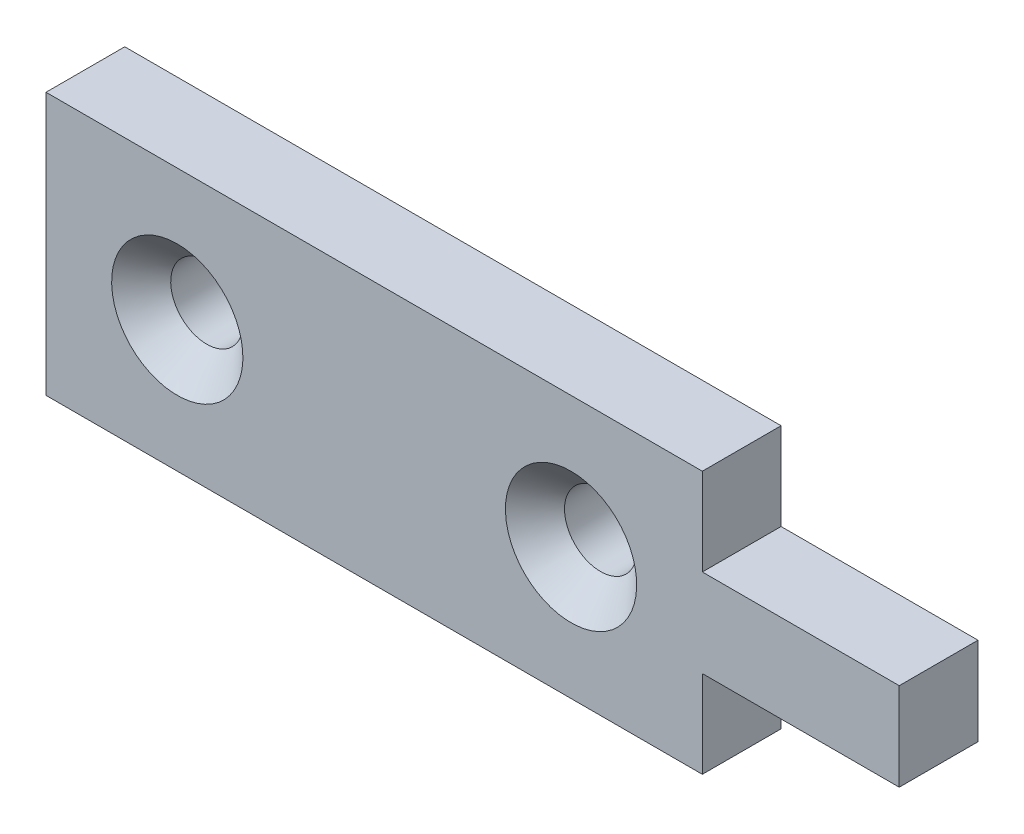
ISO-10303-21;
HEADER;
FILE_DESCRIPTION(('STEP AP214'),'2;1');
FILE_NAME('part.step','',(''),(''),'','','');
FILE_SCHEMA(('AUTOMOTIVE_DESIGN { 1 0 10303 214 1 1 1 1 }'));
ENDSEC;
DATA;
#1=APPLICATION_CONTEXT('core data for automotive mechanical design processes');
#2=APPLICATION_PROTOCOL_DEFINITION('international standard','automotive_design',2000,#1);
#3=PRODUCT_CONTEXT('',#1,'mechanical');
#4=PRODUCT('Part','Part','',(#3));
#5=PRODUCT_RELATED_PRODUCT_CATEGORY('part','',(#4));
#6=PRODUCT_DEFINITION_FORMATION('','',#4);
#7=PRODUCT_DEFINITION_CONTEXT('part definition',#1,'design');
#8=PRODUCT_DEFINITION('design','',#6,#7);
#9=PRODUCT_DEFINITION_SHAPE('','',#8);
#10=(LENGTH_UNIT() NAMED_UNIT(*) SI_UNIT(.MILLI.,.METRE.));
#11=(NAMED_UNIT(*) PLANE_ANGLE_UNIT() SI_UNIT($,.RADIAN.));
#12=(NAMED_UNIT(*) SI_UNIT($,.STERADIAN.) SOLID_ANGLE_UNIT());
#13=UNCERTAINTY_MEASURE_WITH_UNIT(LENGTH_MEASURE(1.E-05),#10,'distance_accuracy_value','');
#14=(GEOMETRIC_REPRESENTATION_CONTEXT(3) GLOBAL_UNCERTAINTY_ASSIGNED_CONTEXT((#13)) GLOBAL_UNIT_ASSIGNED_CONTEXT((#10,
#11,#12)) REPRESENTATION_CONTEXT('',''));
#15=CARTESIAN_POINT('',(0.,0.,0.));
#16=DIRECTION('',(0.,0.,1.));
#17=DIRECTION('',(1.,0.,0.));
#18=AXIS2_PLACEMENT_3D('',#15,#16,#17);
#19=CARTESIAN_POINT('',(55.,3.35,6.));
#20=DIRECTION('',(0.,0.,1.));
#21=DIRECTION('',(0.,1.,0.));
#22=AXIS2_PLACEMENT_3D('',#19,#20,#21);
#23=PLANE('',#22);
#24=CARTESIAN_POINT('',(0.,0.,6.));
#25=DIRECTION('',(0.,0.,1.));
#26=DIRECTION('',(0.,1.,0.));
#27=AXIS2_PLACEMENT_3D('',#24,#25,#26);
#28=CIRCLE('',#27,5.);
#29=CARTESIAN_POINT('',(0.,5.,6.));
#30=VERTEX_POINT('',#29);
#31=EDGE_CURVE('E22',#30,#30,#28,.F.);
#32=ORIENTED_EDGE('',*,*,#31,.T.);
#33=EDGE_LOOP('',(#32));
#34=FACE_BOUND('',#33,.T.);
#35=CARTESIAN_POINT('',(30.,0.,6.));
#36=DIRECTION('',(0.,0.,1.));
#37=DIRECTION('',(0.,1.,0.));
#38=AXIS2_PLACEMENT_3D('',#35,#36,#37);
#39=CIRCLE('',#38,5.);
#40=CARTESIAN_POINT('',(30.,5.,6.));
#41=VERTEX_POINT('',#40);
#42=EDGE_CURVE('E153',#41,#41,#39,.F.);
#43=ORIENTED_EDGE('',*,*,#42,.T.);
#44=EDGE_LOOP('',(#43));
#45=FACE_BOUND('',#44,.T.);
#46=DIRECTION('',(0.,1.,0.));
#47=VECTOR('',#46,1.);
#48=CARTESIAN_POINT('',(55.,-3.35,6.));
#49=LINE('',#48,#47);
#50=CARTESIAN_POINT('',(55.,-3.35,6.));
#51=VERTEX_POINT('',#50);
#52=CARTESIAN_POINT('',(55.,3.35,6.));
#53=VERTEX_POINT('',#52);
#54=EDGE_CURVE('E121',#51,#53,#49,.T.);
#55=ORIENTED_EDGE('',*,*,#54,.T.);
#56=DIRECTION('',(-1.,0.,0.));
#57=VECTOR('',#56,1.);
#58=CARTESIAN_POINT('',(55.,3.35,6.));
#59=LINE('',#58,#57);
#60=CARTESIAN_POINT('',(40.,3.35,6.));
#61=VERTEX_POINT('',#60);
#62=EDGE_CURVE('E95',#53,#61,#59,.T.);
#63=ORIENTED_EDGE('',*,*,#62,.T.);
#64=DIRECTION('',(0.,1.,0.));
#65=VECTOR('',#64,1.);
#66=CARTESIAN_POINT('',(40.,3.35,6.));
#67=LINE('',#66,#65);
#68=CARTESIAN_POINT('',(40.,10.,6.));
#69=VERTEX_POINT('',#68);
#70=EDGE_CURVE('E124',#61,#69,#67,.T.);
#71=ORIENTED_EDGE('',*,*,#70,.T.);
#72=DIRECTION('',(-1.,0.,0.));
#73=VECTOR('',#72,1.);
#74=CARTESIAN_POINT('',(40.,10.,6.));
#75=LINE('',#74,#73);
#76=CARTESIAN_POINT('',(-10.,10.,6.));
#77=VERTEX_POINT('',#76);
#78=EDGE_CURVE('E126',#69,#77,#75,.T.);
#79=ORIENTED_EDGE('',*,*,#78,.T.);
#80=DIRECTION('',(0.,-1.,0.));
#81=VECTOR('',#80,1.);
#82=CARTESIAN_POINT('',(-10.,-10.,6.));
#83=LINE('',#82,#81);
#84=CARTESIAN_POINT('',(-10.,-10.,6.));
#85=VERTEX_POINT('',#84);
#86=EDGE_CURVE('E128',#77,#85,#83,.T.);
#87=ORIENTED_EDGE('',*,*,#86,.T.);
#88=DIRECTION('',(1.,0.,0.));
#89=VECTOR('',#88,1.);
#90=CARTESIAN_POINT('',(40.,-10.,6.));
#91=LINE('',#90,#89);
#92=CARTESIAN_POINT('',(40.,-10.,6.));
#93=VERTEX_POINT('',#92);
#94=EDGE_CURVE('E130',#85,#93,#91,.T.);
#95=ORIENTED_EDGE('',*,*,#94,.T.);
#96=DIRECTION('',(0.,1.,0.));
#97=VECTOR('',#96,1.);
#98=CARTESIAN_POINT('',(40.,-3.35,6.));
#99=LINE('',#98,#97);
#100=CARTESIAN_POINT('',(40.,-3.35,6.));
#101=VERTEX_POINT('',#100);
#102=EDGE_CURVE('E34',#93,#101,#99,.T.);
#103=ORIENTED_EDGE('',*,*,#102,.T.);
#104=DIRECTION('',(1.,0.,0.));
#105=VECTOR('',#104,1.);
#106=CARTESIAN_POINT('',(55.,-3.35,6.));
#107=LINE('',#106,#105);
#108=EDGE_CURVE('E29',#101,#51,#107,.T.);
#109=ORIENTED_EDGE('',*,*,#108,.T.);
#110=EDGE_LOOP('',(#55,#63,#71,#79,#87,#95,#103,#109));
#111=FACE_BOUND('',#110,.T.);
#112=ADVANCED_FACE('F14',(#34,#45,#111),#23,.T.);
#113=CARTESIAN_POINT('',(55.,3.35,0.));
#114=DIRECTION('',(0.,0.,1.));
#115=DIRECTION('',(0.,1.,0.));
#116=AXIS2_PLACEMENT_3D('',#113,#114,#115);
#117=PLANE('',#116);
#118=CARTESIAN_POINT('',(30.,0.,0.));
#119=DIRECTION('',(0.,0.,1.));
#120=DIRECTION('',(0.,1.,0.));
#121=AXIS2_PLACEMENT_3D('',#118,#119,#120);
#122=CIRCLE('',#121,2.75);
#123=CARTESIAN_POINT('',(30.,2.75,0.));
#124=VERTEX_POINT('',#123);
#125=EDGE_CURVE('E103',#124,#124,#122,.T.);
#126=ORIENTED_EDGE('',*,*,#125,.T.);
#127=EDGE_LOOP('',(#126));
#128=FACE_BOUND('',#127,.T.);
#129=DIRECTION('',(0.,1.,0.));
#130=VECTOR('',#129,1.);
#131=CARTESIAN_POINT('',(55.,-3.35,0.));
#132=LINE('',#131,#130);
#133=CARTESIAN_POINT('',(55.,-3.35,0.));
#134=VERTEX_POINT('',#133);
#135=CARTESIAN_POINT('',(55.,3.35,0.));
#136=VERTEX_POINT('',#135);
#137=EDGE_CURVE('E85',#134,#136,#132,.T.);
#138=ORIENTED_EDGE('',*,*,#137,.F.);
#139=DIRECTION('',(1.,0.,0.));
#140=VECTOR('',#139,1.);
#141=CARTESIAN_POINT('',(55.,-3.35,0.));
#142=LINE('',#141,#140);
#143=CARTESIAN_POINT('',(40.,-3.35,0.));
#144=VERTEX_POINT('',#143);
#145=EDGE_CURVE('E119',#144,#134,#142,.T.);
#146=ORIENTED_EDGE('',*,*,#145,.F.);
#147=DIRECTION('',(0.,1.,0.));
#148=VECTOR('',#147,1.);
#149=CARTESIAN_POINT('',(40.,-3.35,0.));
#150=LINE('',#149,#148);
#151=CARTESIAN_POINT('',(40.,-10.,0.));
#152=VERTEX_POINT('',#151);
#153=EDGE_CURVE('E117',#152,#144,#150,.T.);
#154=ORIENTED_EDGE('',*,*,#153,.F.);
#155=DIRECTION('',(1.,0.,0.));
#156=VECTOR('',#155,1.);
#157=CARTESIAN_POINT('',(40.,-10.,0.));
#158=LINE('',#157,#156);
#159=CARTESIAN_POINT('',(-10.,-10.,0.));
#160=VERTEX_POINT('',#159);
#161=EDGE_CURVE('E115',#160,#152,#158,.T.);
#162=ORIENTED_EDGE('',*,*,#161,.F.);
#163=DIRECTION('',(0.,-1.,0.));
#164=VECTOR('',#163,1.);
#165=CARTESIAN_POINT('',(-10.,-10.,0.));
#166=LINE('',#165,#164);
#167=CARTESIAN_POINT('',(-10.,10.,0.));
#168=VERTEX_POINT('',#167);
#169=EDGE_CURVE('E113',#168,#160,#166,.T.);
#170=ORIENTED_EDGE('',*,*,#169,.F.);
#171=DIRECTION('',(-1.,0.,0.));
#172=VECTOR('',#171,1.);
#173=CARTESIAN_POINT('',(40.,10.,0.));
#174=LINE('',#173,#172);
#175=CARTESIAN_POINT('',(40.,10.,0.));
#176=VERTEX_POINT('',#175);
#177=EDGE_CURVE('E111',#176,#168,#174,.T.);
#178=ORIENTED_EDGE('',*,*,#177,.F.);
#179=DIRECTION('',(0.,1.,0.));
#180=VECTOR('',#179,1.);
#181=CARTESIAN_POINT('',(40.,3.35,0.));
#182=LINE('',#181,#180);
#183=CARTESIAN_POINT('',(40.,3.35,0.));
#184=VERTEX_POINT('',#183);
#185=EDGE_CURVE('E87',#184,#176,#182,.T.);
#186=ORIENTED_EDGE('',*,*,#185,.F.);
#187=DIRECTION('',(-1.,0.,0.));
#188=VECTOR('',#187,1.);
#189=CARTESIAN_POINT('',(55.,3.35,0.));
#190=LINE('',#189,#188);
#191=EDGE_CURVE('E79',#136,#184,#190,.T.);
#192=ORIENTED_EDGE('',*,*,#191,.F.);
#193=EDGE_LOOP('',(#138,#146,#154,#162,#170,#178,#186,#192));
#194=FACE_BOUND('',#193,.T.);
#195=CARTESIAN_POINT('',(0.,0.,0.));
#196=DIRECTION('',(0.,0.,1.));
#197=DIRECTION('',(0.,1.,0.));
#198=AXIS2_PLACEMENT_3D('',#195,#196,#197);
#199=CIRCLE('',#198,2.75);
#200=CARTESIAN_POINT('',(0.,2.75,0.));
#201=VERTEX_POINT('',#200);
#202=EDGE_CURVE('E106',#201,#201,#199,.T.);
#203=ORIENTED_EDGE('',*,*,#202,.T.);
#204=EDGE_LOOP('',(#203));
#205=FACE_BOUND('',#204,.T.);
#206=ADVANCED_FACE('F81',(#128,#194,#205),#117,.F.);
#207=CARTESIAN_POINT('',(55.,-3.35,6.));
#208=DIRECTION('',(-1.,0.,0.));
#209=DIRECTION('',(0.,-1.,0.));
#210=AXIS2_PLACEMENT_3D('',#207,#208,#209);
#211=PLANE('',#210);
#212=ORIENTED_EDGE('',*,*,#137,.T.);
#213=DIRECTION('',(0.,0.,-1.));
#214=VECTOR('',#213,1.);
#215=CARTESIAN_POINT('',(55.,3.35,6.));
#216=LINE('',#215,#214);
#217=EDGE_CURVE('E93',#53,#136,#216,.T.);
#218=ORIENTED_EDGE('',*,*,#217,.F.);
#219=ORIENTED_EDGE('',*,*,#54,.F.);
#220=DIRECTION('',(0.,0.,-1.));
#221=VECTOR('',#220,1.);
#222=CARTESIAN_POINT('',(55.,-3.35,6.));
#223=LINE('',#222,#221);
#224=EDGE_CURVE('E102',#51,#134,#223,.T.);
#225=ORIENTED_EDGE('',*,*,#224,.T.);
#226=EDGE_LOOP('',(#212,#218,#219,#225));
#227=FACE_BOUND('',#226,.T.);
#228=ADVANCED_FACE('F16',(#227),#211,.F.);
#229=CARTESIAN_POINT('',(55.,3.35,6.));
#230=DIRECTION('',(0.,-1.,0.));
#231=DIRECTION('',(1.,0.,0.));
#232=AXIS2_PLACEMENT_3D('',#229,#230,#231);
#233=PLANE('',#232);
#234=ORIENTED_EDGE('',*,*,#191,.T.);
#235=DIRECTION('',(0.,0.,-1.));
#236=VECTOR('',#235,1.);
#237=CARTESIAN_POINT('',(40.,3.35,6.));
#238=LINE('',#237,#236);
#239=EDGE_CURVE('E99',#61,#184,#238,.T.);
#240=ORIENTED_EDGE('',*,*,#239,.F.);
#241=ORIENTED_EDGE('',*,*,#62,.F.);
#242=ORIENTED_EDGE('',*,*,#217,.T.);
#243=EDGE_LOOP('',(#234,#240,#241,#242));
#244=FACE_BOUND('',#243,.T.);
#245=ADVANCED_FACE('F94',(#244),#233,.F.);
#246=CARTESIAN_POINT('',(40.,3.35,6.));
#247=DIRECTION('',(-1.,0.,0.));
#248=DIRECTION('',(0.,-1.,0.));
#249=AXIS2_PLACEMENT_3D('',#246,#247,#248);
#250=PLANE('',#249);
#251=ORIENTED_EDGE('',*,*,#185,.T.);
#252=DIRECTION('',(0.,0.,-1.));
#253=VECTOR('',#252,1.);
#254=CARTESIAN_POINT('',(40.,10.,6.));
#255=LINE('',#254,#253);
#256=EDGE_CURVE('E147',#69,#176,#255,.T.);
#257=ORIENTED_EDGE('',*,*,#256,.F.);
#258=ORIENTED_EDGE('',*,*,#70,.F.);
#259=ORIENTED_EDGE('',*,*,#239,.T.);
#260=EDGE_LOOP('',(#251,#257,#258,#259));
#261=FACE_BOUND('',#260,.T.);
#262=ADVANCED_FACE('F205',(#261),#250,.F.);
#263=CARTESIAN_POINT('',(40.,10.,6.));
#264=DIRECTION('',(0.,-1.,0.));
#265=DIRECTION('',(1.,0.,0.));
#266=AXIS2_PLACEMENT_3D('',#263,#264,#265);
#267=PLANE('',#266);
#268=ORIENTED_EDGE('',*,*,#177,.T.);
#269=DIRECTION('',(0.,0.,-1.));
#270=VECTOR('',#269,1.);
#271=CARTESIAN_POINT('',(-10.,10.,6.));
#272=LINE('',#271,#270);
#273=EDGE_CURVE('E144',#77,#168,#272,.T.);
#274=ORIENTED_EDGE('',*,*,#273,.F.);
#275=ORIENTED_EDGE('',*,*,#78,.F.);
#276=ORIENTED_EDGE('',*,*,#256,.T.);
#277=EDGE_LOOP('',(#268,#274,#275,#276));
#278=FACE_BOUND('',#277,.T.);
#279=ADVANCED_FACE('F201',(#278),#267,.F.);
#280=CARTESIAN_POINT('',(-10.,-10.,6.));
#281=DIRECTION('',(1.,0.,0.));
#282=DIRECTION('',(0.,1.,0.));
#283=AXIS2_PLACEMENT_3D('',#280,#281,#282);
#284=PLANE('',#283);
#285=ORIENTED_EDGE('',*,*,#169,.T.);
#286=DIRECTION('',(0.,0.,-1.));
#287=VECTOR('',#286,1.);
#288=CARTESIAN_POINT('',(-10.,-10.,6.));
#289=LINE('',#288,#287);
#290=EDGE_CURVE('E141',#85,#160,#289,.T.);
#291=ORIENTED_EDGE('',*,*,#290,.F.);
#292=ORIENTED_EDGE('',*,*,#86,.F.);
#293=ORIENTED_EDGE('',*,*,#273,.T.);
#294=EDGE_LOOP('',(#285,#291,#292,#293));
#295=FACE_BOUND('',#294,.T.);
#296=ADVANCED_FACE('F197',(#295),#284,.F.);
#297=CARTESIAN_POINT('',(40.,-10.,6.));
#298=DIRECTION('',(0.,1.,0.));
#299=DIRECTION('',(-1.,0.,0.));
#300=AXIS2_PLACEMENT_3D('',#297,#298,#299);
#301=PLANE('',#300);
#302=ORIENTED_EDGE('',*,*,#161,.T.);
#303=DIRECTION('',(0.,0.,-1.));
#304=VECTOR('',#303,1.);
#305=CARTESIAN_POINT('',(40.,-10.,6.));
#306=LINE('',#305,#304);
#307=EDGE_CURVE('E138',#93,#152,#306,.T.);
#308=ORIENTED_EDGE('',*,*,#307,.F.);
#309=ORIENTED_EDGE('',*,*,#94,.F.);
#310=ORIENTED_EDGE('',*,*,#290,.T.);
#311=EDGE_LOOP('',(#302,#308,#309,#310));
#312=FACE_BOUND('',#311,.T.);
#313=ADVANCED_FACE('F193',(#312),#301,.F.);
#314=CARTESIAN_POINT('',(40.,-3.35,6.));
#315=DIRECTION('',(-1.,0.,0.));
#316=DIRECTION('',(0.,-1.,0.));
#317=AXIS2_PLACEMENT_3D('',#314,#315,#316);
#318=PLANE('',#317);
#319=ORIENTED_EDGE('',*,*,#153,.T.);
#320=DIRECTION('',(0.,0.,-1.));
#321=VECTOR('',#320,1.);
#322=CARTESIAN_POINT('',(40.,-3.35,6.));
#323=LINE('',#322,#321);
#324=EDGE_CURVE('E135',#101,#144,#323,.T.);
#325=ORIENTED_EDGE('',*,*,#324,.F.);
#326=ORIENTED_EDGE('',*,*,#102,.F.);
#327=ORIENTED_EDGE('',*,*,#307,.T.);
#328=EDGE_LOOP('',(#319,#325,#326,#327));
#329=FACE_BOUND('',#328,.T.);
#330=ADVANCED_FACE('F189',(#329),#318,.F.);
#331=CARTESIAN_POINT('',(55.,-3.35,6.));
#332=DIRECTION('',(0.,1.,0.));
#333=DIRECTION('',(-1.,0.,0.));
#334=AXIS2_PLACEMENT_3D('',#331,#332,#333);
#335=PLANE('',#334);
#336=ORIENTED_EDGE('',*,*,#145,.T.);
#337=ORIENTED_EDGE('',*,*,#224,.F.);
#338=ORIENTED_EDGE('',*,*,#108,.F.);
#339=ORIENTED_EDGE('',*,*,#324,.T.);
#340=EDGE_LOOP('',(#336,#337,#338,#339));
#341=FACE_BOUND('',#340,.T.);
#342=ADVANCED_FACE('F186',(#341),#335,.F.);
#343=CARTESIAN_POINT('',(30.,0.,6.));
#344=DIRECTION('',(0.,0.,-1.));
#345=DIRECTION('',(0.,-1.,0.));
#346=AXIS2_PLACEMENT_3D('',#343,#344,#345);
#347=CYLINDRICAL_SURFACE('',#346,2.75);
#348=CARTESIAN_POINT('',(30.,0.,3.75));
#349=DIRECTION('',(0.,0.,1.));
#350=DIRECTION('',(0.,1.,0.));
#351=AXIS2_PLACEMENT_3D('',#348,#349,#350);
#352=CIRCLE('',#351,2.75);
#353=CARTESIAN_POINT('',(30.,2.75,3.75));
#354=VERTEX_POINT('',#353);
#355=EDGE_CURVE('E9',#354,#354,#352,.T.);
#356=ORIENTED_EDGE('',*,*,#355,.T.);
#357=EDGE_LOOP('',(#356));
#358=FACE_BOUND('',#357,.T.);
#359=ORIENTED_EDGE('',*,*,#125,.F.);
#360=EDGE_LOOP('',(#359));
#361=FACE_BOUND('',#360,.T.);
#362=ADVANCED_FACE('F170',(#358,#361),#347,.F.);
#363=CARTESIAN_POINT('',(0.,0.,6.));
#364=DIRECTION('',(0.,0.,-1.));
#365=DIRECTION('',(0.,-1.,0.));
#366=AXIS2_PLACEMENT_3D('',#363,#364,#365);
#367=CYLINDRICAL_SURFACE('',#366,2.75);
#368=CARTESIAN_POINT('',(0.,0.,3.75));
#369=DIRECTION('',(0.,0.,1.));
#370=DIRECTION('',(0.,1.,0.));
#371=AXIS2_PLACEMENT_3D('',#368,#369,#370);
#372=CIRCLE('',#371,2.75);
#373=CARTESIAN_POINT('',(0.,2.75,3.75));
#374=VERTEX_POINT('',#373);
#375=EDGE_CURVE('E98',#374,#374,#372,.T.);
#376=ORIENTED_EDGE('',*,*,#375,.T.);
#377=EDGE_LOOP('',(#376));
#378=FACE_BOUND('',#377,.T.);
#379=ORIENTED_EDGE('',*,*,#202,.F.);
#380=EDGE_LOOP('',(#379));
#381=FACE_BOUND('',#380,.T.);
#382=ADVANCED_FACE('F164',(#378,#381),#367,.F.);
#383=CARTESIAN_POINT('',(0.,0.,3.75));
#384=DIRECTION('',(0.,0.,1.));
#385=DIRECTION('',(0.,1.,0.));
#386=AXIS2_PLACEMENT_3D('',#383,#384,#385);
#387=CONICAL_SURFACE('',#386,2.75,0.785398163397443);
#388=ORIENTED_EDGE('',*,*,#31,.F.);
#389=EDGE_LOOP('',(#388));
#390=FACE_BOUND('',#389,.T.);
#391=ORIENTED_EDGE('',*,*,#375,.F.);
#392=EDGE_LOOP('',(#391));
#393=FACE_BOUND('',#392,.T.);
#394=ADVANCED_FACE('F160',(#390,#393),#387,.F.);
#395=CARTESIAN_POINT('',(30.,0.,3.75));
#396=DIRECTION('',(0.,0.,1.));
#397=DIRECTION('',(0.,1.,0.));
#398=AXIS2_PLACEMENT_3D('',#395,#396,#397);
#399=CONICAL_SURFACE('',#398,2.75,0.785398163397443);
#400=ORIENTED_EDGE('',*,*,#42,.F.);
#401=EDGE_LOOP('',(#400));
#402=FACE_BOUND('',#401,.T.);
#403=ORIENTED_EDGE('',*,*,#355,.F.);
#404=EDGE_LOOP('',(#403));
#405=FACE_BOUND('',#404,.T.);
#406=ADVANCED_FACE('F163',(#402,#405),#399,.F.);
#407=CLOSED_SHELL('',(#112,#206,#228,#245,#262,#279,#296,#313,#330,#342,#362,#382,#394,#406));
#408=MANIFOLD_SOLID_BREP('B1',#407);
#409=ADVANCED_BREP_SHAPE_REPRESENTATION('',(#18,#408),#14);
#410=SHAPE_DEFINITION_REPRESENTATION(#9,#409);
ENDSEC;
END-ISO-10303-21;
